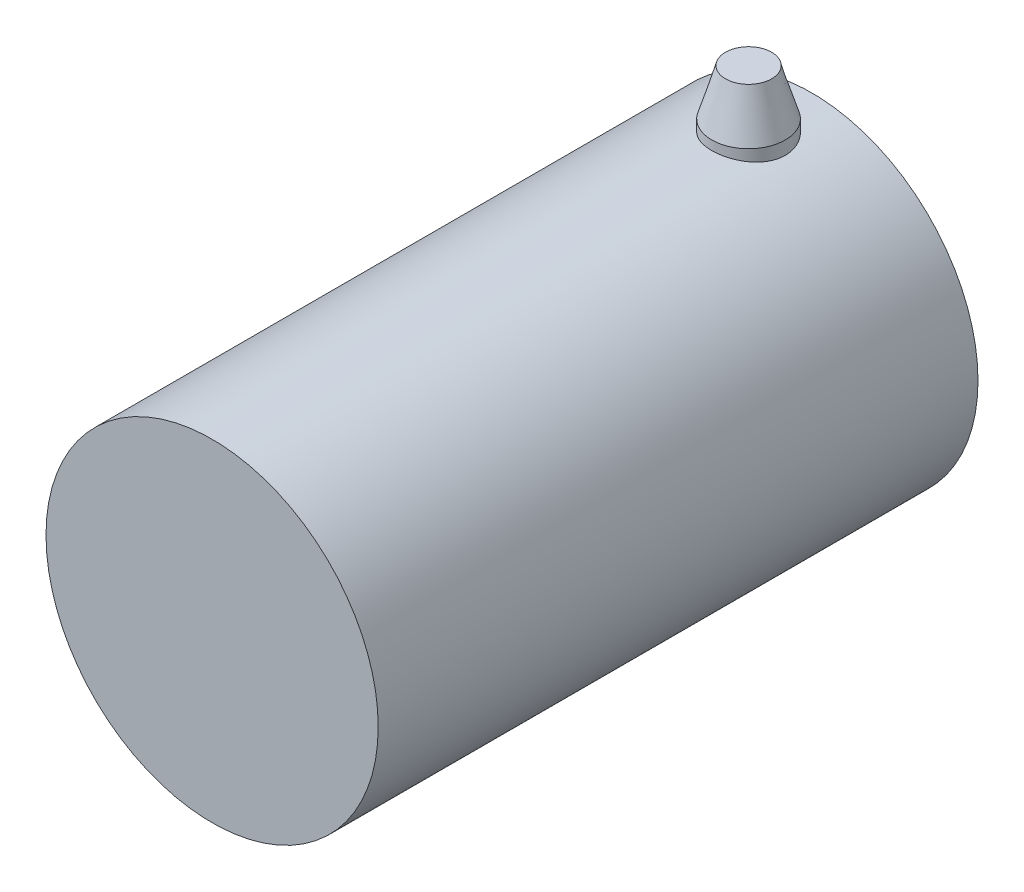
ISO-10303-21;
HEADER;
FILE_DESCRIPTION(('STEP AP214'),'2;1');
FILE_NAME('part.step','',(''),(''),'','','');
FILE_SCHEMA(('AUTOMOTIVE_DESIGN { 1 0 10303 214 1 1 1 1 }'));
ENDSEC;
DATA;
#1=APPLICATION_CONTEXT('core data for automotive mechanical design processes');
#2=APPLICATION_PROTOCOL_DEFINITION('international standard','automotive_design',2000,#1);
#3=PRODUCT_CONTEXT('',#1,'mechanical');
#4=PRODUCT('Part','Part','',(#3));
#5=PRODUCT_RELATED_PRODUCT_CATEGORY('part','',(#4));
#6=PRODUCT_DEFINITION_FORMATION('','',#4);
#7=PRODUCT_DEFINITION_CONTEXT('part definition',#1,'design');
#8=PRODUCT_DEFINITION('design','',#6,#7);
#9=PRODUCT_DEFINITION_SHAPE('','',#8);
#10=(LENGTH_UNIT() NAMED_UNIT(*) SI_UNIT(.MILLI.,.METRE.));
#11=(NAMED_UNIT(*) PLANE_ANGLE_UNIT() SI_UNIT($,.RADIAN.));
#12=(NAMED_UNIT(*) SI_UNIT($,.STERADIAN.) SOLID_ANGLE_UNIT());
#13=UNCERTAINTY_MEASURE_WITH_UNIT(LENGTH_MEASURE(1.E-05),#10,'distance_accuracy_value','');
#14=(GEOMETRIC_REPRESENTATION_CONTEXT(3) GLOBAL_UNCERTAINTY_ASSIGNED_CONTEXT((#13)) GLOBAL_UNIT_ASSIGNED_CONTEXT((#10,
#11,#12)) REPRESENTATION_CONTEXT('',''));
#15=CARTESIAN_POINT('',(0.,0.,0.));
#16=DIRECTION('',(0.,0.,1.));
#17=DIRECTION('',(1.,0.,0.));
#18=AXIS2_PLACEMENT_3D('',#15,#16,#17);
#19=CARTESIAN_POINT('',(0.,0.,65.));
#20=DIRECTION('',(0.,0.,-1.));
#21=DIRECTION('',(-1.,0.,0.));
#22=AXIS2_PLACEMENT_3D('',#19,#20,#21);
#23=CYLINDRICAL_SURFACE('',#22,18.);
#24=CARTESIAN_POINT('',(0.,18.,10.8417423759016));
#25=CARTESIAN_POINT('',(-0.220604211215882,17.9999959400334,10.8417349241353));
#26=CARTESIAN_POINT('',(-0.44129796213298,17.9959033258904,10.8233323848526));
#27=CARTESIAN_POINT('',(-0.876412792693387,17.9799724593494,10.750287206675));
#28=CARTESIAN_POINT('',(-1.09082934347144,17.9681287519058,10.6956190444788));
#29=CARTESIAN_POINT('',(-1.50703891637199,17.9380139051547,10.5518416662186));
#30=CARTESIAN_POINT('',(-1.7088450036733,17.919749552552,10.4627688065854));
#31=CARTESIAN_POINT('',(-2.09464175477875,17.8787628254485,10.2528267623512));
#32=CARTESIAN_POINT('',(-2.27863280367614,17.8560405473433,10.1319582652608));
#33=CARTESIAN_POINT('',(-2.62659439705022,17.8082098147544,9.85976284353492));
#34=CARTESIAN_POINT('',(-2.79023165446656,17.7830712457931,9.70801511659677));
#35=CARTESIAN_POINT('',(-3.08995021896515,17.7334525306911,9.37927201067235));
#36=CARTESIAN_POINT('',(-3.22602902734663,17.7089724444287,9.20227434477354));
#37=CARTESIAN_POINT('',(-3.4682451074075,17.663145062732,8.82558284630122));
#38=CARTESIAN_POINT('',(-3.57402632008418,17.6418363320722,8.62565495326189));
#39=CARTESIAN_POINT('',(-3.75036013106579,17.6051970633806,8.21031168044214));
#40=CARTESIAN_POINT('',(-3.82091703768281,17.5898657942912,7.99489819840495));
#41=CARTESIAN_POINT('',(-3.9236954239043,17.5672242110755,7.55831748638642));
#42=CARTESIAN_POINT('',(-3.9565076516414,17.5597904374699,7.33729586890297));
#43=CARTESIAN_POINT('',(-3.98470235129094,17.5534148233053,6.8927695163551));
#44=CARTESIAN_POINT('',(-3.98008952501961,17.5544719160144,6.66926509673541));
#45=CARTESIAN_POINT('',(-3.93404017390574,17.5648468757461,6.23051860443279));
#46=CARTESIAN_POINT('',(-3.8932911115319,17.5740105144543,6.01520017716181));
#47=CARTESIAN_POINT('',(-3.77721567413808,17.5993220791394,5.59453336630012));
#48=CARTESIAN_POINT('',(-3.7018873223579,17.6154704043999,5.3891855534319));
#49=CARTESIAN_POINT('',(-3.51816356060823,17.6530830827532,4.99236265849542));
#50=CARTESIAN_POINT('',(-3.40950485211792,17.6745894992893,4.8010136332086));
#51=CARTESIAN_POINT('',(-3.16238986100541,17.720469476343,4.4390110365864));
#52=CARTESIAN_POINT('',(-3.02392943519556,17.7448434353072,4.26836034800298));
#53=CARTESIAN_POINT('',(-2.7175077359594,17.7943730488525,3.9486418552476));
#54=CARTESIAN_POINT('',(-2.54896218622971,17.8195340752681,3.80013429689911));
#55=CARTESIAN_POINT('',(-2.18907214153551,17.8673126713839,3.53340043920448));
#56=CARTESIAN_POINT('',(-1.99772721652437,17.8899301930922,3.41517471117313));
#57=CARTESIAN_POINT('',(-1.59697817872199,17.9301492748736,3.21221748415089));
#58=CARTESIAN_POINT('',(-1.38753507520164,17.947739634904,3.12756061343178));
#59=CARTESIAN_POINT('',(-0.956920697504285,17.9758393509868,2.99479878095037));
#60=CARTESIAN_POINT('',(-0.735751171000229,17.9863497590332,2.94668838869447));
#61=CARTESIAN_POINT('',(-0.292766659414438,17.9989551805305,2.88920288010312));
#62=CARTESIAN_POINT('',(-0.0710555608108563,18.0012163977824,2.87906263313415));
#63=CARTESIAN_POINT('',(0.370892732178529,17.9975349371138,2.89572969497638));
#64=CARTESIAN_POINT('',(0.591130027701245,17.9915928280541,2.92253444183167));
#65=CARTESIAN_POINT('',(1.02133527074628,17.9722773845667,3.01169636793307));
#66=CARTESIAN_POINT('',(1.23139073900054,17.9589882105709,3.07365111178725));
#67=CARTESIAN_POINT('',(1.638127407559,17.9264665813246,3.23090677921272));
#68=CARTESIAN_POINT('',(1.83480745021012,17.9072336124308,3.32621058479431));
#69=CARTESIAN_POINT('',(2.21236581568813,17.8645485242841,3.5490454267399));
#70=CARTESIAN_POINT('',(2.39297309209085,17.8410391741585,3.67702450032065));
#71=CARTESIAN_POINT('',(2.73042261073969,17.7925238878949,3.9609882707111));
#72=CARTESIAN_POINT('',(2.88726169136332,17.7675177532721,4.1169766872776));
#73=CARTESIAN_POINT('',(3.17575682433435,17.7182514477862,4.45604546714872));
#74=CARTESIAN_POINT('',(3.30688252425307,17.6940142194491,4.6395810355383));
#75=CARTESIAN_POINT('',(3.53645308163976,17.6495673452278,5.02651757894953));
#76=CARTESIAN_POINT('',(3.63489936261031,17.6293575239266,5.22991768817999));
#77=CARTESIAN_POINT('',(3.79564495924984,17.5954492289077,5.64971376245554));
#78=CARTESIAN_POINT('',(3.85814903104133,17.5817139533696,5.86602820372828));
#79=CARTESIAN_POINT('',(3.94583251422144,17.5622453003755,6.30643314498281));
#80=CARTESIAN_POINT('',(3.97101804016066,17.5565106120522,6.53052236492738));
#81=CARTESIAN_POINT('',(3.98308500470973,17.5537762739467,6.97476521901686));
#82=CARTESIAN_POINT('',(3.97080775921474,17.5565847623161,7.19489523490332));
#83=CARTESIAN_POINT('',(3.91018161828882,17.5701857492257,7.62986629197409));
#84=CARTESIAN_POINT('',(3.8618331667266,17.580978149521,7.84470739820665));
#85=CARTESIAN_POINT('',(3.73084739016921,17.6092364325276,8.26231666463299));
#86=CARTESIAN_POINT('',(3.64833497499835,17.6266779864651,8.46512575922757));
#87=CARTESIAN_POINT('',(3.45146989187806,17.6662784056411,8.85414610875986));
#88=CARTESIAN_POINT('',(3.33711382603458,17.6884377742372,9.04035558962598));
#89=CARTESIAN_POINT('',(3.07702778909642,17.7355483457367,9.39503268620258));
#90=CARTESIAN_POINT('',(2.93069931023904,17.7605477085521,9.56305510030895));
#91=CARTESIAN_POINT('',(2.61203192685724,17.8102005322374,9.87243585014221));
#92=CARTESIAN_POINT('',(2.43968701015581,17.8348539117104,10.0137880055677));
#93=CARTESIAN_POINT('',(2.07111420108,17.8814263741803,10.2676194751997));
#94=CARTESIAN_POINT('',(1.87459896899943,17.903304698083,10.3796894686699));
#95=CARTESIAN_POINT('',(1.46507646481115,17.9414517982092,10.5690296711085));
#96=CARTESIAN_POINT('',(1.25208306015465,17.9577252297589,10.6463287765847));
#97=CARTESIAN_POINT('',(0.865762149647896,17.9799593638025,10.750313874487));
#98=CARTESIAN_POINT('',(0.694509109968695,17.9874277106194,10.784533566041));
#99=CARTESIAN_POINT('',(0.348855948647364,17.9974495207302,10.8302502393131));
#100=CARTESIAN_POINT('',(0.174455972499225,18.0000032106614,10.8417482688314));
#101=CARTESIAN_POINT('',(0.,18.,10.8417423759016));
#102=B_SPLINE_CURVE_WITH_KNOTS('',3,(#24,#25,#26,#27,#28,#29,#30,#31,#32,#33,#34,#35,#36,#37,
#38,#39,#40,#41,#42,#43,#44,#45,#46,#47,#48,#49,#50,#51,#52,#53,#54,#55,#56,#57,#58,#59,#60,#61,
#62,#63,#64,#65,#66,#67,#68,#69,#70,#71,#72,#73,#74,#75,#76,#77,#78,#79,#80,#81,#82,#83,#84,#85,
#86,#87,#88,#89,#90,#91,#92,#93,#94,#95,#96,#97,#98,#99,#100,#101),.UNSPECIFIED.,.T.,.F.,(4,2,2,
2,2,2,2,2,2,2,2,2,2,2,2,2,2,2,2,2,2,2,2,2,2,2,2,2,2,2,2,2,2,2,2,2,2,2,4),(0.,0.661174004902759,
1.32281383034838,1.98375638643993,2.64468465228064,3.31530846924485,3.9859930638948,
4.66426337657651,5.34245070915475,6.00987266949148,6.67721078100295,7.33211934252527,
7.98706534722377,8.64732459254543,9.30767568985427,9.98261865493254,10.6575743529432,
11.3340222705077,12.0103696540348,12.6730123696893,13.3356091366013,13.9907685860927,
14.6459846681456,15.3107187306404,15.9755411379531,16.6528938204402,17.3302169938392,
18.003642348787,18.6769573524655,19.3352636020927,19.9935617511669,20.6494740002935,
21.3054562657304,21.9749698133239,22.6446383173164,23.3232197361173,24.0012361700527,
24.5241231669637,25.0469860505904),.UNSPECIFIED.);
#103=CARTESIAN_POINT('',(0.,18.,10.8417423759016));
#104=VERTEX_POINT('',#103);
#105=EDGE_CURVE('E70',#104,#104,#102,.T.);
#106=ORIENTED_EDGE('',*,*,#105,.T.);
#107=EDGE_LOOP('',(#106));
#108=FACE_BOUND('',#107,.T.);
#109=CARTESIAN_POINT('',(0.,0.,65.));
#110=DIRECTION('',(0.,0.,1.));
#111=DIRECTION('',(1.,0.,0.));
#112=AXIS2_PLACEMENT_3D('',#109,#110,#111);
#113=CIRCLE('',#112,18.);
#114=CARTESIAN_POINT('',(18.,0.,65.));
#115=VERTEX_POINT('',#114);
#116=EDGE_CURVE('E54',#115,#115,#113,.T.);
#117=ORIENTED_EDGE('',*,*,#116,.F.);
#118=EDGE_LOOP('',(#117));
#119=FACE_BOUND('',#118,.T.);
#120=CARTESIAN_POINT('',(0.,0.,0.));
#121=DIRECTION('',(0.,0.,1.));
#122=DIRECTION('',(1.,0.,0.));
#123=AXIS2_PLACEMENT_3D('',#120,#121,#122);
#124=CIRCLE('',#123,18.);
#125=CARTESIAN_POINT('',(18.,0.,0.));
#126=VERTEX_POINT('',#125);
#127=EDGE_CURVE('E60',#126,#126,#124,.T.);
#128=ORIENTED_EDGE('',*,*,#127,.T.);
#129=EDGE_LOOP('',(#128));
#130=FACE_BOUND('',#129,.T.);
#131=ADVANCED_FACE('F44',(#108,#119,#130),#23,.T.);
#132=CARTESIAN_POINT('',(0.,0.,65.));
#133=DIRECTION('',(0.,0.,1.));
#134=DIRECTION('',(1.,0.,0.));
#135=AXIS2_PLACEMENT_3D('',#132,#133,#134);
#136=PLANE('',#135);
#137=ORIENTED_EDGE('',*,*,#116,.T.);
#138=EDGE_LOOP('',(#137));
#139=FACE_BOUND('',#138,.T.);
#140=ADVANCED_FACE('F104',(#139),#136,.T.);
#141=CARTESIAN_POINT('',(0.,0.,0.));
#142=DIRECTION('',(0.,0.,1.));
#143=DIRECTION('',(1.,0.,0.));
#144=AXIS2_PLACEMENT_3D('',#141,#142,#143);
#145=PLANE('',#144);
#146=CARTESIAN_POINT('',(0.,0.,0.));
#147=DIRECTION('',(0.,0.,-1.));
#148=DIRECTION('',(-1.,0.,0.));
#149=AXIS2_PLACEMENT_3D('',#146,#147,#148);
#150=CIRCLE('',#149,4.);
#151=CARTESIAN_POINT('',(-4.,0.,0.));
#152=VERTEX_POINT('',#151);
#153=EDGE_CURVE('E11',#152,#152,#150,.T.);
#154=ORIENTED_EDGE('',*,*,#153,.F.);
#155=EDGE_LOOP('',(#154));
#156=FACE_BOUND('',#155,.T.);
#157=ORIENTED_EDGE('',*,*,#127,.F.);
#158=EDGE_LOOP('',(#157));
#159=FACE_BOUND('',#158,.T.);
#160=ADVANCED_FACE('F102',(#156,#159),#145,.F.);
#161=CARTESIAN_POINT('',(0.,0.,-1.99999999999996));
#162=DIRECTION('',(0.,0.,1.));
#163=DIRECTION('',(1.,0.,0.));
#164=AXIS2_PLACEMENT_3D('',#161,#162,#163);
#165=CYLINDRICAL_SURFACE('',#164,4.);
#166=CARTESIAN_POINT('',(0.,0.,-1.99999999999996));
#167=DIRECTION('',(0.,0.,1.));
#168=DIRECTION('',(1.,0.,0.));
#169=AXIS2_PLACEMENT_3D('',#166,#167,#168);
#170=CIRCLE('',#169,4.);
#171=CARTESIAN_POINT('',(1.95996460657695,3.48690962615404,-1.99999999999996));
#172=VERTEX_POINT('',#171);
#173=EDGE_CURVE('E69',#172,#172,#170,.F.);
#174=ORIENTED_EDGE('',*,*,#173,.F.);
#175=EDGE_LOOP('',(#174));
#176=FACE_BOUND('',#175,.T.);
#177=ORIENTED_EDGE('',*,*,#153,.T.);
#178=EDGE_LOOP('',(#177));
#179=FACE_BOUND('',#178,.T.);
#180=ADVANCED_FACE('F87',(#176,#179),#165,.T.);
#181=CARTESIAN_POINT('',(0.,17.,6.86315648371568));
#182=DIRECTION('',(0.,1.,0.));
#183=DIRECTION('',(0.,0.,1.));
#184=AXIS2_PLACEMENT_3D('',#181,#182,#183);
#185=CYLINDRICAL_SURFACE('',#184,3.9785858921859);
#186=CARTESIAN_POINT('',(0.,19.,6.86315648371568));
#187=DIRECTION('',(0.,1.,0.));
#188=DIRECTION('',(0.,0.,1.));
#189=AXIS2_PLACEMENT_3D('',#186,#187,#188);
#190=CIRCLE('',#189,3.9785858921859);
#191=CARTESIAN_POINT('',(-0.865461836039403,19.,10.7464696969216));
#192=VERTEX_POINT('',#191);
#193=EDGE_CURVE('E79',#192,#192,#190,.T.);
#194=ORIENTED_EDGE('',*,*,#193,.F.);
#195=EDGE_LOOP('',(#194));
#196=FACE_BOUND('',#195,.T.);
#197=ORIENTED_EDGE('',*,*,#105,.F.);
#198=EDGE_LOOP('',(#197));
#199=FACE_BOUND('',#198,.T.);
#200=ADVANCED_FACE('F81',(#196,#199),#185,.T.);
#201=CARTESIAN_POINT('',(0.,0.,-6.99999999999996));
#202=DIRECTION('',(0.,0.,-1.));
#203=DIRECTION('',(-1.,0.,0.));
#204=AXIS2_PLACEMENT_3D('',#201,#202,#203);
#205=PLANE('',#204);
#206=CARTESIAN_POINT('',(0.,0.,-6.99999999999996));
#207=DIRECTION('',(0.,0.,-1.));
#208=DIRECTION('',(-1.,0.,0.));
#209=AXIS2_PLACEMENT_3D('',#206,#207,#208);
#210=CIRCLE('',#209,2.49999999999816);
#211=CARTESIAN_POINT('',(0.647553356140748,2.41467899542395,-6.99999999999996));
#212=VERTEX_POINT('',#211);
#213=EDGE_CURVE('E218',#212,#212,#210,.T.);
#214=ORIENTED_EDGE('',*,*,#213,.T.);
#215=EDGE_LOOP('',(#214));
#216=FACE_BOUND('',#215,.T.);
#217=ADVANCED_FACE('F86',(#216),#205,.T.);
#218=CARTESIAN_POINT('',(0.647553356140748,2.41467899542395,-6.99999999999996));
#219=CARTESIAN_POINT('',(1.95996460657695,3.48690962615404,-1.99999999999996));
#220=CARTESIAN_POINT('',(-4.18180463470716,3.70978570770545,-6.99999999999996));
#221=CARTESIAN_POINT('',(-5.01385464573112,7.40683883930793,-1.99999999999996));
#222=CARTESIAN_POINT('',(-5.47691134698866,-1.11957228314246,-6.99999999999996));
#223=CARTESIAN_POINT('',(-8.93378385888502,0.433019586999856,-1.99999999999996));
#224=CARTESIAN_POINT('',(-0.647553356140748,-2.41467899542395,-6.99999999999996));
#225=CARTESIAN_POINT('',(-1.95996460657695,-3.48690962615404,-1.99999999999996));
#226=CARTESIAN_POINT('',(4.18180463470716,-3.70978570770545,-6.99999999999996));
#227=CARTESIAN_POINT('',(5.01385464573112,-7.40683883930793,-1.99999999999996));
#228=CARTESIAN_POINT('',(5.47691134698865,1.11957228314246,-6.99999999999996));
#229=CARTESIAN_POINT('',(8.93378385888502,-0.433019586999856,-1.99999999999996));
#230=CARTESIAN_POINT('',(0.647553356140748,2.41467899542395,-6.99999999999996));
#231=CARTESIAN_POINT('',(1.95996460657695,3.48690962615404,-1.99999999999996));
#232=(BOUNDED_SURFACE() B_SPLINE_SURFACE(3,1,((#218,#219),(#220,#221),(#222,#223),(#224,#225),
(#226,#227),(#228,#229),(#230,#231)),.UNSPECIFIED.,.T.,.F.,.F.) B_SPLINE_SURFACE_WITH_KNOTS((4,
3,4),(2,2),(0.,0.5,1.),(0.,1.),
.UNSPECIFIED.) GEOMETRIC_REPRESENTATION_ITEM() RATIONAL_B_SPLINE_SURFACE(((1.,1.),
(0.333333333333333,0.333333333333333),(0.333333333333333,0.333333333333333),(1.,1.),
(0.333333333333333,0.333333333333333),(0.333333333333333,0.333333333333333),(1.,1.))) REPRESENTATION_ITEM('') SURFACE());
#233=CARTESIAN_POINT('',(0.647553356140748,2.41467899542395,-6.99999999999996));
#234=CARTESIAN_POINT('',(0.661224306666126,2.42584806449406,-6.94791666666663));
#235=CARTESIAN_POINT('',(0.674895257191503,2.43701713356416,-6.8958333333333));
#236=CARTESIAN_POINT('',(0.702237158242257,2.45935527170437,-6.79166666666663));
#237=CARTESIAN_POINT('',(0.715908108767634,2.47052434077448,-6.7395833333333));
#238=CARTESIAN_POINT('',(0.743250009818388,2.49286247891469,-6.63541666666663));
#239=CARTESIAN_POINT('',(0.756920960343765,2.50403154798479,-6.58333333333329));
#240=CARTESIAN_POINT('',(0.784262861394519,2.526369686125,-6.47916666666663));
#241=CARTESIAN_POINT('',(0.797933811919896,2.53753875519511,-6.42708333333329));
#242=CARTESIAN_POINT('',(0.82527571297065,2.55987689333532,-6.32291666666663));
#243=CARTESIAN_POINT('',(0.838946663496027,2.57104596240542,-6.27083333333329));
#244=CARTESIAN_POINT('',(0.866288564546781,2.59338410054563,-6.16666666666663));
#245=CARTESIAN_POINT('',(0.879959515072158,2.60455316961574,-6.1145833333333));
#246=CARTESIAN_POINT('',(0.907301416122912,2.62689130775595,-6.01041666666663));
#247=CARTESIAN_POINT('',(0.92097236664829,2.63806037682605,-5.9583333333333));
#248=CARTESIAN_POINT('',(0.948314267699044,2.66039851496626,-5.85416666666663));
#249=CARTESIAN_POINT('',(0.961985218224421,2.67156758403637,-5.8020833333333));
#250=CARTESIAN_POINT('',(0.989327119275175,2.69390572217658,-5.69791666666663));
#251=CARTESIAN_POINT('',(1.00299806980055,2.70507479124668,-5.64583333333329));
#252=CARTESIAN_POINT('',(1.03033997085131,2.72741292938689,-5.54166666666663));
#253=CARTESIAN_POINT('',(1.04401092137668,2.738581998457,-5.48958333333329));
#254=CARTESIAN_POINT('',(1.07135282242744,2.76092013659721,-5.38541666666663));
#255=CARTESIAN_POINT('',(1.08502377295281,2.77208920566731,-5.3333333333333));
#256=CARTESIAN_POINT('',(1.11236567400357,2.79442734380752,-5.22916666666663));
#257=CARTESIAN_POINT('',(1.12603662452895,2.80559641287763,-5.1770833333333));
#258=CARTESIAN_POINT('',(1.1533785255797,2.82793455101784,-5.07291666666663));
#259=CARTESIAN_POINT('',(1.16704947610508,2.83910362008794,-5.0208333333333));
#260=CARTESIAN_POINT('',(1.19439137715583,2.86144175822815,-4.91666666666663));
#261=CARTESIAN_POINT('',(1.20806232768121,2.87261082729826,-4.8645833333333));
#262=CARTESIAN_POINT('',(1.23540422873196,2.89494896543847,-4.76041666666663));
#263=CARTESIAN_POINT('',(1.24907517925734,2.90611803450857,-4.7083333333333));
#264=CARTESIAN_POINT('',(1.27641708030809,2.92845617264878,-4.60416666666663));
#265=CARTESIAN_POINT('',(1.29008803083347,2.93962524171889,-4.5520833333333));
#266=CARTESIAN_POINT('',(1.31742993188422,2.9619633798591,-4.44791666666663));
#267=CARTESIAN_POINT('',(1.3311008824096,2.9731324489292,-4.3958333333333));
#268=CARTESIAN_POINT('',(1.35844278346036,2.99547058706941,-4.29166666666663));
#269=CARTESIAN_POINT('',(1.37211373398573,3.00663965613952,-4.2395833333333));
#270=CARTESIAN_POINT('',(1.39945563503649,3.02897779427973,-4.13541666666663));
#271=CARTESIAN_POINT('',(1.41312658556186,3.04014686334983,-4.0833333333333));
#272=CARTESIAN_POINT('',(1.44046848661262,3.06248500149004,-3.97916666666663));
#273=CARTESIAN_POINT('',(1.454139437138,3.07365407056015,-3.9270833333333));
#274=CARTESIAN_POINT('',(1.48148133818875,3.09599220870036,-3.82291666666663));
#275=CARTESIAN_POINT('',(1.49515228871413,3.10716127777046,-3.77083333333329));
#276=CARTESIAN_POINT('',(1.52249418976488,3.12949941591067,-3.66666666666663));
#277=CARTESIAN_POINT('',(1.53616514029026,3.14066848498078,-3.6145833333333));
#278=CARTESIAN_POINT('',(1.56350704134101,3.16300662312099,-3.51041666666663));
#279=CARTESIAN_POINT('',(1.57717799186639,3.17417569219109,-3.45833333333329));
#280=CARTESIAN_POINT('',(1.60451989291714,3.19651383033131,-3.35416666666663));
#281=CARTESIAN_POINT('',(1.61819084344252,3.20768289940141,-3.3020833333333));
#282=CARTESIAN_POINT('',(1.64553274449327,3.23002103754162,-3.19791666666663));
#283=CARTESIAN_POINT('',(1.65920369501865,3.24119010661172,-3.1458333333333));
#284=CARTESIAN_POINT('',(1.68654559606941,3.26352824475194,-3.04166666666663));
#285=CARTESIAN_POINT('',(1.70021654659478,3.27469731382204,-2.9895833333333));
#286=CARTESIAN_POINT('',(1.72755844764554,3.29703545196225,-2.88541666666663));
#287=CARTESIAN_POINT('',(1.74122939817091,3.30820452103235,-2.83333333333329));
#288=CARTESIAN_POINT('',(1.76857129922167,3.33054265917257,-2.72916666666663));
#289=CARTESIAN_POINT('',(1.78224224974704,3.34171172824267,-2.6770833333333));
#290=CARTESIAN_POINT('',(1.8095841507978,3.36404986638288,-2.57291666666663));
#291=CARTESIAN_POINT('',(1.82325510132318,3.37521893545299,-2.5208333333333));
#292=CARTESIAN_POINT('',(1.85059700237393,3.3975570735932,-2.41666666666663));
#293=CARTESIAN_POINT('',(1.86426795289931,3.4087261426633,-2.3645833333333));
#294=CARTESIAN_POINT('',(1.89160985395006,3.43106428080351,-2.26041666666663));
#295=CARTESIAN_POINT('',(1.90528080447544,3.44223334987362,-2.2083333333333));
#296=CARTESIAN_POINT('',(1.93262270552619,3.46457148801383,-2.10416666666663));
#297=CARTESIAN_POINT('',(1.94629365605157,3.47574055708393,-2.0520833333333));
#298=CARTESIAN_POINT('',(1.95996460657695,3.48690962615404,-1.99999999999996));
#299=B_SPLINE_CURVE_WITH_KNOTS('',3,(#233,#234,#235,#236,#237,#238,#239,#240,#241,#242,#243,
#244,#245,#246,#247,#248,#249,#250,#251,#252,#253,#254,#255,#256,#257,#258,#259,#260,#261,#262,
#263,#264,#265,#266,#267,#268,#269,#270,#271,#272,#273,#274,#275,#276,#277,#278,#279,#280,#281,
#282,#283,#284,#285,#286,#287,#288,#289,#290,#291,#292,#293,#294,#295,#296,#297,#298),
.UNSPECIFIED.,.F.,.F.,(4,2,2,2,2,2,2,2,2,2,2,2,2,2,2,2,2,2,2,2,2,2,2,2,2,2,2,2,2,2,2,2,4),(0.,
0.164981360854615,0.329962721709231,0.494944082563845,0.659925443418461,0.824906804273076,
0.989888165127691,1.15486952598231,1.31985088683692,1.48483224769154,1.64981360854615,
1.81479496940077,1.97977633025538,2.14475769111,2.30973905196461,2.47472041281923,
2.63970177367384,2.80468313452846,2.96966449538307,3.13464585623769,3.29962721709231,
3.46460857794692,3.62958993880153,3.79457129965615,3.95955266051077,4.12453402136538,
4.28951538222,4.45449674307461,4.61947810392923,4.78445946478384,4.94944082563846,
5.11442218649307,5.27940354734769),.UNSPECIFIED.);
#300=EDGE_CURVE('BSEAM138',#212,#172,#299,.T.);
#301=ORIENTED_EDGE('',*,*,#213,.F.);
#302=ORIENTED_EDGE('',*,*,#173,.T.);
#303=ORIENTED_EDGE('',*,*,#300,.T.);
#304=ORIENTED_EDGE('',*,*,#300,.F.);
#305=EDGE_LOOP('',(#301,#303,#302,#304));
#306=FACE_BOUND('',#305,.T.);
#307=ADVANCED_FACE('F138',(#306),#232,.T.);
#308=CARTESIAN_POINT('',(0.,24.,6.86315648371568));
#309=DIRECTION('',(0.,1.,0.));
#310=DIRECTION('',(0.,0.,1.));
#311=AXIS2_PLACEMENT_3D('',#308,#309,#310);
#312=PLANE('',#311);
#313=CARTESIAN_POINT('',(0.,24.,6.86315648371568));
#314=DIRECTION('',(0.,1.,0.));
#315=DIRECTION('',(0.,0.,1.));
#316=AXIS2_PLACEMENT_3D('',#313,#314,#315);
#317=CIRCLE('',#316,2.49999999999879);
#318=CARTESIAN_POINT('',(0.,24.,9.36315648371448));
#319=VERTEX_POINT('',#318);
#320=EDGE_CURVE('E207',#319,#319,#317,.T.);
#321=ORIENTED_EDGE('',*,*,#320,.T.);
#322=EDGE_LOOP('',(#321));
#323=FACE_BOUND('',#322,.T.);
#324=ADVANCED_FACE('F150',(#323),#312,.T.);
#325=CARTESIAN_POINT('',(0.,24.,9.36315648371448));
#326=CARTESIAN_POINT('',(-0.865461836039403,19.,10.7464696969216));
#327=CARTESIAN_POINT('',(-4.99999999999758,24.,9.36315648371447));
#328=CARTESIAN_POINT('',(-8.63208826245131,19.,9.01554602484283));
#329=CARTESIAN_POINT('',(-4.99999999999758,24.,4.36315648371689));
#330=CARTESIAN_POINT('',(-6.90116459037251,19.,1.24891959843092));
#331=CARTESIAN_POINT('',(0.,24.,4.36315648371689));
#332=CARTESIAN_POINT('',(0.865461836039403,19.,2.97984327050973));
#333=CARTESIAN_POINT('',(4.99999999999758,24.,4.36315648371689));
#334=CARTESIAN_POINT('',(8.63208826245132,19.,4.71076694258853));
#335=CARTESIAN_POINT('',(4.99999999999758,24.,9.36315648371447));
#336=CARTESIAN_POINT('',(6.90116459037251,19.,12.4773933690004));
#337=CARTESIAN_POINT('',(0.,24.,9.36315648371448));
#338=CARTESIAN_POINT('',(-0.865461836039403,19.,10.7464696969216));
#339=(BOUNDED_SURFACE() B_SPLINE_SURFACE(3,1,((#325,#326),(#327,#328),(#329,#330),(#331,#332),
(#333,#334),(#335,#336),(#337,#338)),.UNSPECIFIED.,.T.,.F.,.F.) B_SPLINE_SURFACE_WITH_KNOTS((4,
3,4),(2,2),(0.,0.5,1.),(0.,1.),
.UNSPECIFIED.) GEOMETRIC_REPRESENTATION_ITEM() RATIONAL_B_SPLINE_SURFACE(((1.,1.),
(0.333333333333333,0.333333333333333),(0.333333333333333,0.333333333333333),(1.,1.),
(0.333333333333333,0.333333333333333),(0.333333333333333,0.333333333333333),(1.,1.))) REPRESENTATION_ITEM('') SURFACE());
#340=CARTESIAN_POINT('',(0.,24.,9.36315648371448));
#341=CARTESIAN_POINT('',(-0.00901522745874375,23.9479166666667,9.37756599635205));
#342=CARTESIAN_POINT('',(-0.0180304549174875,23.8958333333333,9.39197550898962));
#343=CARTESIAN_POINT('',(-0.0360609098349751,23.7916666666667,9.42079453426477));
#344=CARTESIAN_POINT('',(-0.0450761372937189,23.7395833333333,9.43520404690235));
#345=CARTESIAN_POINT('',(-0.0631065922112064,23.6354166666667,9.4640230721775));
#346=CARTESIAN_POINT('',(-0.0721218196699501,23.5833333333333,9.47843258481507));
#347=CARTESIAN_POINT('',(-0.0901522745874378,23.4791666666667,9.50725161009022));
#348=CARTESIAN_POINT('',(-0.0991675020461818,23.4270833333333,9.5216611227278));
#349=CARTESIAN_POINT('',(-0.117197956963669,23.3229166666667,9.55048014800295));
#350=CARTESIAN_POINT('',(-0.126213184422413,23.2708333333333,9.56488966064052));
#351=CARTESIAN_POINT('',(-0.1442436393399,23.1666666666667,9.59370868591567));
#352=CARTESIAN_POINT('',(-0.153258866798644,23.1145833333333,9.60811819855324));
#353=CARTESIAN_POINT('',(-0.171289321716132,23.0104166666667,9.63693722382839));
#354=CARTESIAN_POINT('',(-0.180304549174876,22.9583333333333,9.65134673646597));
#355=CARTESIAN_POINT('',(-0.198335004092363,22.8541666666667,9.68016576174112));
#356=CARTESIAN_POINT('',(-0.207350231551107,22.8020833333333,9.69457527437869));
#357=CARTESIAN_POINT('',(-0.225380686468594,22.6979166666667,9.72339429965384));
#358=CARTESIAN_POINT('',(-0.234395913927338,22.6458333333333,9.73780381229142));
#359=CARTESIAN_POINT('',(-0.252426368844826,22.5416666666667,9.76662283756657));
#360=CARTESIAN_POINT('',(-0.26144159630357,22.4895833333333,9.78103235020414));
#361=CARTESIAN_POINT('',(-0.279472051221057,22.3854166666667,9.80985137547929));
#362=CARTESIAN_POINT('',(-0.288487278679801,22.3333333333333,9.82426088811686));
#363=CARTESIAN_POINT('',(-0.306517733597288,22.2291666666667,9.85307991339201));
#364=CARTESIAN_POINT('',(-0.315532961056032,22.1770833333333,9.86748942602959));
#365=CARTESIAN_POINT('',(-0.33356341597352,22.0729166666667,9.89630845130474));
#366=CARTESIAN_POINT('',(-0.342578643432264,22.0208333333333,9.91071796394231));
#367=CARTESIAN_POINT('',(-0.360609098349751,21.9166666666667,9.93953698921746));
#368=CARTESIAN_POINT('',(-0.369624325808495,21.8645833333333,9.95394650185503));
#369=CARTESIAN_POINT('',(-0.387654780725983,21.7604166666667,9.98276552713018));
#370=CARTESIAN_POINT('',(-0.396670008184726,21.7083333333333,9.99717503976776));
#371=CARTESIAN_POINT('',(-0.414700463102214,21.6041666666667,10.0259940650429));
#372=CARTESIAN_POINT('',(-0.423715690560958,21.5520833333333,10.0404035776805));
#373=CARTESIAN_POINT('',(-0.441746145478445,21.4479166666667,10.0692226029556));
#374=CARTESIAN_POINT('',(-0.450761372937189,21.3958333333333,10.0836321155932));
#375=CARTESIAN_POINT('',(-0.468791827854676,21.2916666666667,10.1124511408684));
#376=CARTESIAN_POINT('',(-0.477807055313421,21.2395833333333,10.1268606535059));
#377=CARTESIAN_POINT('',(-0.495837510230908,21.1354166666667,10.1556796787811));
#378=CARTESIAN_POINT('',(-0.504852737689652,21.0833333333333,10.1700891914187));
#379=CARTESIAN_POINT('',(-0.522883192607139,20.9791666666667,10.1989082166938));
#380=CARTESIAN_POINT('',(-0.531898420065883,20.9270833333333,10.2133177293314));
#381=CARTESIAN_POINT('',(-0.549928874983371,20.8229166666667,10.2421367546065));
#382=CARTESIAN_POINT('',(-0.558944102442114,20.7708333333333,10.2565462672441));
#383=CARTESIAN_POINT('',(-0.576974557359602,20.6666666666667,10.2853652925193));
#384=CARTESIAN_POINT('',(-0.585989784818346,20.6145833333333,10.2997748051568));
#385=CARTESIAN_POINT('',(-0.604020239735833,20.5104166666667,10.328593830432));
#386=CARTESIAN_POINT('',(-0.613035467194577,20.4583333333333,10.3430033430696));
#387=CARTESIAN_POINT('',(-0.631065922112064,20.3541666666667,10.3718223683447));
#388=CARTESIAN_POINT('',(-0.640081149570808,20.3020833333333,10.3862318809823));
#389=CARTESIAN_POINT('',(-0.658111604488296,20.1979166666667,10.4150509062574));
#390=CARTESIAN_POINT('',(-0.66712683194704,20.1458333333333,10.429460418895));
#391=CARTESIAN_POINT('',(-0.685157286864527,20.0416666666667,10.4582794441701));
#392=CARTESIAN_POINT('',(-0.694172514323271,19.9895833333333,10.4726889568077));
#393=CARTESIAN_POINT('',(-0.712202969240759,19.8854166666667,10.5015079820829));
#394=CARTESIAN_POINT('',(-0.721218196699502,19.8333333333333,10.5159174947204));
#395=CARTESIAN_POINT('',(-0.73924865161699,19.7291666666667,10.5447365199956));
#396=CARTESIAN_POINT('',(-0.748263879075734,19.6770833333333,10.5591460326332));
#397=CARTESIAN_POINT('',(-0.766294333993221,19.5729166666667,10.5879650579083));
#398=CARTESIAN_POINT('',(-0.775309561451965,19.5208333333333,10.6023745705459));
#399=CARTESIAN_POINT('',(-0.793340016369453,19.4166666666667,10.631193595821));
#400=CARTESIAN_POINT('',(-0.802355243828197,19.3645833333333,10.6456031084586));
#401=CARTESIAN_POINT('',(-0.820385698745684,19.2604166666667,10.6744221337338));
#402=CARTESIAN_POINT('',(-0.829400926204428,19.2083333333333,10.6888316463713));
#403=CARTESIAN_POINT('',(-0.847431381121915,19.1041666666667,10.7176506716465));
#404=CARTESIAN_POINT('',(-0.856446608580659,19.0520833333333,10.7320601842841));
#405=CARTESIAN_POINT('',(-0.865461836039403,19.,10.7464696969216));
#406=B_SPLINE_CURVE_WITH_KNOTS('',3,(#340,#341,#342,#343,#344,#345,#346,#347,#348,#349,#350,
#351,#352,#353,#354,#355,#356,#357,#358,#359,#360,#361,#362,#363,#364,#365,#366,#367,#368,#369,
#370,#371,#372,#373,#374,#375,#376,#377,#378,#379,#380,#381,#382,#383,#384,#385,#386,#387,#388,
#389,#390,#391,#392,#393,#394,#395,#396,#397,#398,#399,#400,#401,#402,#403,#404,#405),
.UNSPECIFIED.,.F.,.F.,(4,2,2,2,2,2,2,2,2,2,2,2,2,2,2,2,2,2,2,2,2,2,2,2,2,2,2,2,2,2,2,2,4),(0.,
0.164360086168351,0.328720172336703,0.493080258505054,0.657440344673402,0.821800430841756,
0.986160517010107,1.15052060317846,1.31488068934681,1.47924077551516,1.64360086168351,
1.80796094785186,1.97232103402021,2.13668112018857,2.30104120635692,2.46540129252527,
2.62976137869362,2.79412146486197,2.95848155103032,3.12284163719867,3.28720172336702,
3.45156180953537,3.61592189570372,3.78028198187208,3.94464206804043,4.10900215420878,
4.27336224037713,4.43772232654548,4.60208241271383,4.76644249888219,4.93080258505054,
5.09516267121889,5.25952275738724),.UNSPECIFIED.);
#407=EDGE_CURVE('BSEAM170',#319,#192,#406,.T.);
#408=ORIENTED_EDGE('',*,*,#320,.F.);
#409=ORIENTED_EDGE('',*,*,#193,.T.);
#410=ORIENTED_EDGE('',*,*,#407,.T.);
#411=ORIENTED_EDGE('',*,*,#407,.F.);
#412=EDGE_LOOP('',(#408,#410,#409,#411));
#413=FACE_BOUND('',#412,.T.);
#414=ADVANCED_FACE('F170',(#413),#339,.T.);
#415=CLOSED_SHELL('',(#131,#140,#160,#180,#200,#217,#307,#324,#414));
#416=CARTESIAN_POINT('',(0.,0.,-0.999999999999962));
#417=DIRECTION('',(0.,0.,-1.));
#418=DIRECTION('',(-1.,0.,0.));
#419=AXIS2_PLACEMENT_3D('',#416,#417,#418);
#420=PLANE('',#419);
#421=CARTESIAN_POINT('',(0.,0.,-0.999999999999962));
#422=DIRECTION('',(0.,0.,-1.));
#423=DIRECTION('',(-1.,0.,0.));
#424=AXIS2_PLACEMENT_3D('',#421,#422,#423);
#425=CIRCLE('',#424,3.);
#426=CARTESIAN_POINT('',(-3.,0.,-0.999999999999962));
#427=VERTEX_POINT('',#426);
#428=EDGE_CURVE('E78',#427,#427,#425,.T.);
#429=ORIENTED_EDGE('',*,*,#428,.T.);
#430=EDGE_LOOP('',(#429));
#431=FACE_BOUND('',#430,.T.);
#432=ADVANCED_FACE('F91',(#431),#420,.T.);
#433=CARTESIAN_POINT('',(0.,0.,-0.999999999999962));
#434=DIRECTION('',(0.,0.,-1.));
#435=DIRECTION('',(-1.,0.,0.));
#436=AXIS2_PLACEMENT_3D('',#433,#434,#435);
#437=CYLINDRICAL_SURFACE('',#436,3.);
#438=ORIENTED_EDGE('',*,*,#428,.F.);
#439=EDGE_LOOP('',(#438));
#440=FACE_BOUND('',#439,.T.);
#441=CARTESIAN_POINT('',(0.,0.,-1.99999999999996));
#442=DIRECTION('',(0.,0.,-1.));
#443=DIRECTION('',(-1.,0.,0.));
#444=AXIS2_PLACEMENT_3D('',#441,#442,#443);
#445=CIRCLE('',#444,3.);
#446=CARTESIAN_POINT('',(-3.,0.,-1.99999999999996));
#447=VERTEX_POINT('',#446);
#448=EDGE_CURVE('E63',#447,#447,#445,.T.);
#449=ORIENTED_EDGE('',*,*,#448,.T.);
#450=EDGE_LOOP('',(#449));
#451=FACE_BOUND('',#450,.T.);
#452=ADVANCED_FACE('F94',(#440,#451),#437,.F.);
#453=CARTESIAN_POINT('',(0.,0.,-1.99999999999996));
#454=DIRECTION('',(0.,0.,-1.));
#455=DIRECTION('',(-1.,0.,0.));
#456=AXIS2_PLACEMENT_3D('',#453,#454,#455);
#457=PLANE('',#456);
#458=ORIENTED_EDGE('',*,*,#448,.F.);
#459=EDGE_LOOP('',(#458));
#460=FACE_BOUND('',#459,.T.);
#461=ADVANCED_FACE('F89',(#460),#457,.F.);
#462=CLOSED_SHELL('',(#432,#452,#461));
#463=ORIENTED_CLOSED_SHELL('',*,#462,.T.);
#464=BREP_WITH_VOIDS('B2',#415,(#463));
#465=ADVANCED_BREP_SHAPE_REPRESENTATION('',(#18,#464),#14);
#466=SHAPE_DEFINITION_REPRESENTATION(#9,#465);
ENDSEC;
END-ISO-10303-21;
